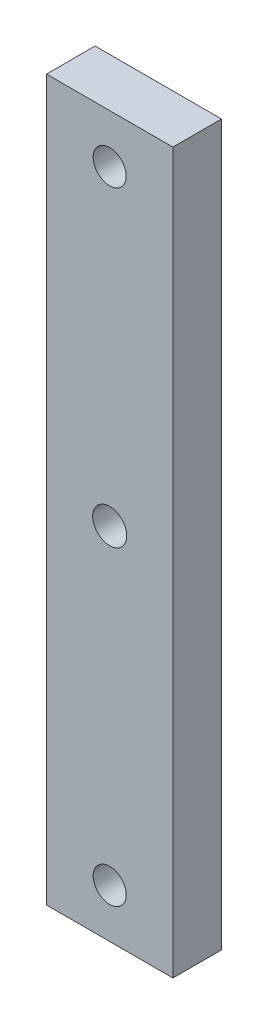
from build123d import *

# Parameters (mm, degrees)
ESQUISSE1_W             = 65
ESQUISSE1_H             = 370
EXTRUSION1_DEPTH        = 25
ESQUISSE3_R             = 8.5
ENL_V_MAT_EXTRU_1_DEPTH = 926.60790835
ESQUISSE6_R             = 8.75
ENL_V_MAT_EXTRU_2_DEPTH = 926.60790835


with BuildPart() as part:
    # Esquisse1 → Extrusion1 (new body)
    with BuildSketch(Plane.XY):
        with Locations((837.5, -130)):
            Rectangle(ESQUISSE1_W, ESQUISSE1_H)
    extrude(amount=EXTRUSION1_DEPTH)

    # Esquisse3 → Enl_v. mat.-Extru.1 (cut, through all)
    with BuildSketch(Plane.XY.offset(25)):
        with Locations((837.5, 30)):
            Circle(ESQUISSE3_R)
        with Locations((837.5, -290)):
            Circle(ESQUISSE3_R)
    extrude(amount=-ENL_V_MAT_EXTRU_1_DEPTH, mode=Mode.SUBTRACT)

    # Esquisse6 → Enl_v. mat.-Extru.2 (cut, through all)
    with BuildSketch(Plane.XY.offset(25)):
        with Locations((837.5, -130)):
            Circle(ESQUISSE6_R)
    extrude(amount=-ENL_V_MAT_EXTRU_2_DEPTH, mode=Mode.SUBTRACT)


solid = part.part
